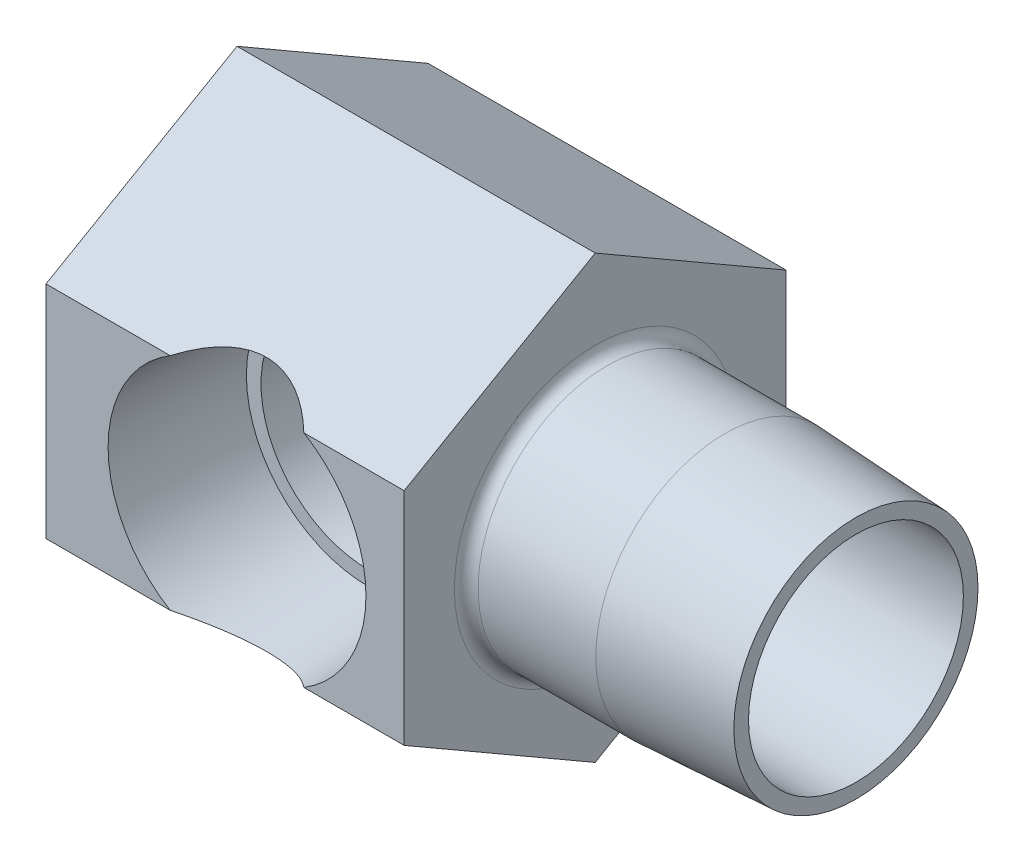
ISO-10303-21;
HEADER;
FILE_DESCRIPTION(('STEP AP214'),'2;1');
FILE_NAME('part.step','',(''),(''),'','','');
FILE_SCHEMA(('AUTOMOTIVE_DESIGN { 1 0 10303 214 1 1 1 1 }'));
ENDSEC;
DATA;
#1=APPLICATION_CONTEXT('core data for automotive mechanical design processes');
#2=APPLICATION_PROTOCOL_DEFINITION('international standard','automotive_design',2000,#1);
#3=PRODUCT_CONTEXT('',#1,'mechanical');
#4=PRODUCT('Part','Part','',(#3));
#5=PRODUCT_RELATED_PRODUCT_CATEGORY('part','',(#4));
#6=PRODUCT_DEFINITION_FORMATION('','',#4);
#7=PRODUCT_DEFINITION_CONTEXT('part definition',#1,'design');
#8=PRODUCT_DEFINITION('design','',#6,#7);
#9=PRODUCT_DEFINITION_SHAPE('','',#8);
#10=(LENGTH_UNIT() NAMED_UNIT(*) SI_UNIT(.MILLI.,.METRE.));
#11=(NAMED_UNIT(*) PLANE_ANGLE_UNIT() SI_UNIT($,.RADIAN.));
#12=(NAMED_UNIT(*) SI_UNIT($,.STERADIAN.) SOLID_ANGLE_UNIT());
#13=UNCERTAINTY_MEASURE_WITH_UNIT(LENGTH_MEASURE(1.E-05),#10,'distance_accuracy_value','');
#14=(GEOMETRIC_REPRESENTATION_CONTEXT(3) GLOBAL_UNCERTAINTY_ASSIGNED_CONTEXT((#13)) GLOBAL_UNIT_ASSIGNED_CONTEXT((#10,
#11,#12)) REPRESENTATION_CONTEXT('',''));
#15=CARTESIAN_POINT('',(0.,0.,0.));
#16=DIRECTION('',(0.,0.,1.));
#17=DIRECTION('',(1.,0.,0.));
#18=AXIS2_PLACEMENT_3D('',#15,#16,#17);
#19=CARTESIAN_POINT('',(8.72389569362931,0.,0.));
#20=DIRECTION('',(-1.,0.,0.));
#21=DIRECTION('',(0.,-1.,0.));
#22=AXIS2_PLACEMENT_3D('',#19,#20,#21);
#23=PLANE('',#22);
#24=CARTESIAN_POINT('',(8.72389569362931,0.,0.));
#25=DIRECTION('',(-1.,0.,0.));
#26=DIRECTION('',(0.,-1.,0.));
#27=AXIS2_PLACEMENT_3D('',#24,#25,#26);
#28=CIRCLE('',#27,7.1437499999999);
#29=CARTESIAN_POINT('',(8.72389569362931,-7.1437499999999,0.));
#30=VERTEX_POINT('',#29);
#31=EDGE_CURVE('E153',#30,#30,#28,.F.);
#32=ORIENTED_EDGE('',*,*,#31,.F.);
#33=EDGE_LOOP('',(#32));
#34=FACE_BOUND('',#33,.T.);
#35=CARTESIAN_POINT('',(8.72389569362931,0.,0.));
#36=DIRECTION('',(1.,0.,0.));
#37=DIRECTION('',(0.,0.,-1.));
#38=AXIS2_PLACEMENT_3D('',#35,#36,#37);
#39=CIRCLE('',#38,8.1153);
#40=CARTESIAN_POINT('',(8.72389569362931,0.,-8.1153));
#41=VERTEX_POINT('',#40);
#42=EDGE_CURVE('E154',#41,#41,#39,.T.);
#43=ORIENTED_EDGE('',*,*,#42,.T.);
#44=EDGE_LOOP('',(#43));
#45=FACE_BOUND('',#44,.T.);
#46=ADVANCED_FACE('F14',(#34,#45),#23,.F.);
#47=CARTESIAN_POINT('',(-8.61160430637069,14.6646968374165,0.));
#48=DIRECTION('',(0.,-0.866025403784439,-0.5));
#49=DIRECTION('',(0.,0.5,-0.866025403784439));
#50=AXIS2_PLACEMENT_3D('',#47,#48,#49);
#51=PLANE('',#50);
#52=CARTESIAN_POINT('',(-19.7241043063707,-0.84553451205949,26.86450873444));
#53=DIRECTION('',(0.,-0.866025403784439,-0.5));
#54=DIRECTION('',(0.,-0.5,0.866025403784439));
#55=AXIS2_PLACEMENT_3D('',#52,#53,#54);
#56=ELLIPSE('',#55,18.6296608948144,9.27637524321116);
#57=CARTESIAN_POINT('',(-15.282885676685,7.33234841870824,12.7));
#58=VERTEX_POINT('',#57);
#59=CARTESIAN_POINT('',(-24.1653229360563,7.33234841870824,12.7));
#60=VERTEX_POINT('',#59);
#61=EDGE_CURVE('E208',#58,#60,#56,.F.);
#62=ORIENTED_EDGE('',*,*,#61,.F.);
#63=DIRECTION('',(-1.,0.,0.));
#64=VECTOR('',#63,1.);
#65=CARTESIAN_POINT('',(-8.61160430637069,7.33234841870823,12.7));
#66=LINE('',#65,#64);
#67=CARTESIAN_POINT('',(-8.61160430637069,7.33234841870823,12.7));
#68=VERTEX_POINT('',#67);
#69=EDGE_CURVE('E178',#68,#58,#66,.T.);
#70=ORIENTED_EDGE('',*,*,#69,.F.);
#71=DIRECTION('',(0.,-0.5,0.866025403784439));
#72=VECTOR('',#71,1.);
#73=CARTESIAN_POINT('',(-8.61160430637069,14.6646968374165,0.));
#74=LINE('',#73,#72);
#75=CARTESIAN_POINT('',(-8.61160430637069,14.6646968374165,0.));
#76=VERTEX_POINT('',#75);
#77=EDGE_CURVE('E198',#76,#68,#74,.T.);
#78=ORIENTED_EDGE('',*,*,#77,.F.);
#79=DIRECTION('',(-1.,0.,0.));
#80=VECTOR('',#79,1.);
#81=CARTESIAN_POINT('',(-8.61160430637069,14.6646968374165,0.));
#82=LINE('',#81,#80);
#83=CARTESIAN_POINT('',(-32.4241043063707,14.6646968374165,0.));
#84=VERTEX_POINT('',#83);
#85=EDGE_CURVE('E175',#76,#84,#82,.T.);
#86=ORIENTED_EDGE('',*,*,#85,.T.);
#87=DIRECTION('',(0.,-0.5,0.866025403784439));
#88=VECTOR('',#87,1.);
#89=CARTESIAN_POINT('',(-32.4241043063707,14.6646968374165,0.));
#90=LINE('',#89,#88);
#91=CARTESIAN_POINT('',(-32.4241043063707,7.33234841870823,12.7));
#92=VERTEX_POINT('',#91);
#93=EDGE_CURVE('E215',#84,#92,#90,.T.);
#94=ORIENTED_EDGE('',*,*,#93,.T.);
#95=EDGE_CURVE('E181',#60,#92,#66,.T.);
#96=ORIENTED_EDGE('',*,*,#95,.F.);
#97=EDGE_LOOP('',(#62,#70,#78,#86,#94,#96));
#98=FACE_BOUND('',#97,.T.);
#99=ADVANCED_FACE('F241',(#98),#51,.F.);
#100=CARTESIAN_POINT('',(-8.61160430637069,7.33234841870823,12.7));
#101=DIRECTION('',(0.,0.,-1.));
#102=DIRECTION('',(-1.,0.,0.));
#103=AXIS2_PLACEMENT_3D('',#100,#101,#102);
#104=PLANE('',#103);
#105=CARTESIAN_POINT('',(-19.7241043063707,0.,12.7));
#106=DIRECTION('',(0.,0.,-1.));
#107=DIRECTION('',(-1.,0.,0.));
#108=AXIS2_PLACEMENT_3D('',#105,#106,#107);
#109=CIRCLE('',#108,8.5725);
#110=CARTESIAN_POINT('',(-15.2828856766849,-7.33234841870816,12.7));
#111=VERTEX_POINT('',#110);
#112=EDGE_CURVE('E225',#58,#111,#109,.T.);
#113=ORIENTED_EDGE('',*,*,#112,.T.);
#114=DIRECTION('',(-1.,0.,0.));
#115=VECTOR('',#114,1.);
#116=CARTESIAN_POINT('',(-8.61160430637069,-7.33234841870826,12.7));
#117=LINE('',#116,#115);
#118=CARTESIAN_POINT('',(-8.61160430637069,-7.33234841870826,12.7));
#119=VERTEX_POINT('',#118);
#120=EDGE_CURVE('E182',#119,#111,#117,.T.);
#121=ORIENTED_EDGE('',*,*,#120,.F.);
#122=DIRECTION('',(0.,-1.,0.));
#123=VECTOR('',#122,1.);
#124=CARTESIAN_POINT('',(-8.61160430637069,7.33234841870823,12.7));
#125=LINE('',#124,#123);
#126=EDGE_CURVE('E196',#68,#119,#125,.T.);
#127=ORIENTED_EDGE('',*,*,#126,.F.);
#128=ORIENTED_EDGE('',*,*,#69,.T.);
#129=EDGE_LOOP('',(#113,#121,#127,#128));
#130=FACE_BOUND('',#129,.T.);
#131=ADVANCED_FACE('F247',(#130),#104,.F.);
#132=CARTESIAN_POINT('',(-24.1653229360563,-7.33234841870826,12.7));
#133=VERTEX_POINT('',#132);
#134=EDGE_CURVE('E37',#133,#60,#109,.T.);
#135=ORIENTED_EDGE('',*,*,#134,.T.);
#136=ORIENTED_EDGE('',*,*,#95,.T.);
#137=DIRECTION('',(0.,-1.,0.));
#138=VECTOR('',#137,1.);
#139=CARTESIAN_POINT('',(-32.4241043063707,7.33234841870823,12.7));
#140=LINE('',#139,#138);
#141=CARTESIAN_POINT('',(-32.4241043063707,-7.33234841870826,12.7));
#142=VERTEX_POINT('',#141);
#143=EDGE_CURVE('E211',#92,#142,#140,.T.);
#144=ORIENTED_EDGE('',*,*,#143,.T.);
#145=EDGE_CURVE('E185',#133,#142,#117,.T.);
#146=ORIENTED_EDGE('',*,*,#145,.F.);
#147=EDGE_LOOP('',(#135,#136,#144,#146));
#148=FACE_BOUND('',#147,.T.);
#149=ADVANCED_FACE('F254',(#148),#104,.F.);
#150=CARTESIAN_POINT('',(-8.61160430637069,-7.33234841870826,12.7));
#151=DIRECTION('',(0.,0.86602540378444,-0.5));
#152=DIRECTION('',(0.,0.5,0.86602540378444));
#153=AXIS2_PLACEMENT_3D('',#150,#151,#152);
#154=PLANE('',#153);
#155=CARTESIAN_POINT('',(-19.7241043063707,0.845534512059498,26.8645087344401));
#156=DIRECTION('',(0.,0.86602540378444,-0.5));
#157=DIRECTION('',(0.,0.5,0.86602540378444));
#158=AXIS2_PLACEMENT_3D('',#155,#156,#157);
#159=ELLIPSE('',#158,18.6296608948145,9.27637524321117);
#160=EDGE_CURVE('E9',#133,#111,#159,.F.);
#161=ORIENTED_EDGE('',*,*,#160,.F.);
#162=ORIENTED_EDGE('',*,*,#145,.T.);
#163=DIRECTION('',(0.,-0.5,-0.86602540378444));
#164=VECTOR('',#163,1.);
#165=CARTESIAN_POINT('',(-32.4241043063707,-7.33234841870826,12.7));
#166=LINE('',#165,#164);
#167=CARTESIAN_POINT('',(-32.4241043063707,-14.6646968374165,0.));
#168=VERTEX_POINT('',#167);
#169=EDGE_CURVE('E194',#142,#168,#166,.T.);
#170=ORIENTED_EDGE('',*,*,#169,.T.);
#171=DIRECTION('',(-1.,0.,0.));
#172=VECTOR('',#171,1.);
#173=CARTESIAN_POINT('',(-8.61160430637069,-14.6646968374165,0.));
#174=LINE('',#173,#172);
#175=CARTESIAN_POINT('',(-8.61160430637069,-14.6646968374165,0.));
#176=VERTEX_POINT('',#175);
#177=EDGE_CURVE('E186',#176,#168,#174,.T.);
#178=ORIENTED_EDGE('',*,*,#177,.F.);
#179=DIRECTION('',(0.,-0.5,-0.86602540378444));
#180=VECTOR('',#179,1.);
#181=CARTESIAN_POINT('',(-8.61160430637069,-7.33234841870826,12.7));
#182=LINE('',#181,#180);
#183=EDGE_CURVE('E189',#119,#176,#182,.T.);
#184=ORIENTED_EDGE('',*,*,#183,.F.);
#185=ORIENTED_EDGE('',*,*,#120,.T.);
#186=EDGE_LOOP('',(#161,#162,#170,#178,#184,#185));
#187=FACE_BOUND('',#186,.T.);
#188=ADVANCED_FACE('F270',(#187),#154,.F.);
#189=CARTESIAN_POINT('',(-8.61160430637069,-14.6646968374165,0.));
#190=DIRECTION('',(0.,0.866025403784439,0.5));
#191=DIRECTION('',(0.,-0.5,0.866025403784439));
#192=AXIS2_PLACEMENT_3D('',#189,#190,#191);
#193=PLANE('',#192);
#194=DIRECTION('',(0.,0.5,-0.866025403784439));
#195=VECTOR('',#194,1.);
#196=CARTESIAN_POINT('',(-32.4241043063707,-14.6646968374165,0.));
#197=LINE('',#196,#195);
#198=CARTESIAN_POINT('',(-32.4241043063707,-7.33234841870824,-12.7));
#199=VERTEX_POINT('',#198);
#200=EDGE_CURVE('E203',#168,#199,#197,.T.);
#201=ORIENTED_EDGE('',*,*,#200,.T.);
#202=DIRECTION('',(-1.,0.,0.));
#203=VECTOR('',#202,1.);
#204=CARTESIAN_POINT('',(-8.61160430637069,-7.33234841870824,-12.7));
#205=LINE('',#204,#203);
#206=CARTESIAN_POINT('',(-8.61160430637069,-7.33234841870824,-12.7));
#207=VERTEX_POINT('',#206);
#208=EDGE_CURVE('E169',#207,#199,#205,.T.);
#209=ORIENTED_EDGE('',*,*,#208,.F.);
#210=DIRECTION('',(0.,0.5,-0.866025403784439));
#211=VECTOR('',#210,1.);
#212=CARTESIAN_POINT('',(-8.61160430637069,-14.6646968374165,0.));
#213=LINE('',#212,#211);
#214=EDGE_CURVE('E190',#176,#207,#213,.T.);
#215=ORIENTED_EDGE('',*,*,#214,.F.);
#216=ORIENTED_EDGE('',*,*,#177,.T.);
#217=EDGE_LOOP('',(#201,#209,#215,#216));
#218=FACE_BOUND('',#217,.T.);
#219=ADVANCED_FACE('F267',(#218),#193,.F.);
#220=CARTESIAN_POINT('',(-8.61160430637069,-7.33234841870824,-12.7));
#221=DIRECTION('',(0.,0.,1.));
#222=DIRECTION('',(0.,-1.,0.));
#223=AXIS2_PLACEMENT_3D('',#220,#221,#222);
#224=PLANE('',#223);
#225=DIRECTION('',(0.,1.,0.));
#226=VECTOR('',#225,1.);
#227=CARTESIAN_POINT('',(-32.4241043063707,-7.33234841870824,-12.7));
#228=LINE('',#227,#226);
#229=CARTESIAN_POINT('',(-32.4241043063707,7.33234841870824,-12.7));
#230=VERTEX_POINT('',#229);
#231=EDGE_CURVE('E207',#199,#230,#228,.T.);
#232=ORIENTED_EDGE('',*,*,#231,.T.);
#233=DIRECTION('',(-1.,0.,0.));
#234=VECTOR('',#233,1.);
#235=CARTESIAN_POINT('',(-8.61160430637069,7.33234841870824,-12.7));
#236=LINE('',#235,#234);
#237=CARTESIAN_POINT('',(-8.61160430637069,7.33234841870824,-12.7));
#238=VERTEX_POINT('',#237);
#239=EDGE_CURVE('E172',#238,#230,#236,.T.);
#240=ORIENTED_EDGE('',*,*,#239,.F.);
#241=DIRECTION('',(0.,1.,0.));
#242=VECTOR('',#241,1.);
#243=CARTESIAN_POINT('',(-8.61160430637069,-7.33234841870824,-12.7));
#244=LINE('',#243,#242);
#245=EDGE_CURVE('E193',#207,#238,#244,.T.);
#246=ORIENTED_EDGE('',*,*,#245,.F.);
#247=ORIENTED_EDGE('',*,*,#208,.T.);
#248=EDGE_LOOP('',(#232,#240,#246,#247));
#249=FACE_BOUND('',#248,.T.);
#250=ADVANCED_FACE('F264',(#249),#224,.F.);
#251=CARTESIAN_POINT('',(-8.61160430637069,7.33234841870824,-12.7));
#252=DIRECTION('',(0.,-0.866025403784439,0.5));
#253=DIRECTION('',(0.,-0.5,-0.866025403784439));
#254=AXIS2_PLACEMENT_3D('',#251,#252,#253);
#255=PLANE('',#254);
#256=DIRECTION('',(0.,0.5,0.866025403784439));
#257=VECTOR('',#256,1.);
#258=CARTESIAN_POINT('',(-32.4241043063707,7.33234841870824,-12.7));
#259=LINE('',#258,#257);
#260=EDGE_CURVE('E219',#230,#84,#259,.T.);
#261=ORIENTED_EDGE('',*,*,#260,.T.);
#262=ORIENTED_EDGE('',*,*,#85,.F.);
#263=DIRECTION('',(0.,0.5,0.866025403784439));
#264=VECTOR('',#263,1.);
#265=CARTESIAN_POINT('',(-8.61160430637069,7.33234841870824,-12.7));
#266=LINE('',#265,#264);
#267=EDGE_CURVE('E200',#238,#76,#266,.T.);
#268=ORIENTED_EDGE('',*,*,#267,.F.);
#269=ORIENTED_EDGE('',*,*,#239,.T.);
#270=EDGE_LOOP('',(#261,#262,#268,#269));
#271=FACE_BOUND('',#270,.T.);
#272=ADVANCED_FACE('F260',(#271),#255,.F.);
#273=CARTESIAN_POINT('',(-8.61160430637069,-21.9970452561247,12.7));
#274=DIRECTION('',(-1.,0.,0.));
#275=DIRECTION('',(0.,-1.,0.));
#276=AXIS2_PLACEMENT_3D('',#273,#274,#275);
#277=PLANE('',#276);
#278=CARTESIAN_POINT('',(-8.61160430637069,0.,0.));
#279=DIRECTION('',(-1.,0.,0.));
#280=DIRECTION('',(0.,-1.,0.));
#281=AXIS2_PLACEMENT_3D('',#278,#279,#280);
#282=CIRCLE('',#281,9.3599);
#283=CARTESIAN_POINT('',(-8.61160430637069,-9.35989999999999,0.));
#284=VERTEX_POINT('',#283);
#285=EDGE_CURVE('E166',#284,#284,#282,.T.);
#286=ORIENTED_EDGE('',*,*,#285,.T.);
#287=EDGE_LOOP('',(#286));
#288=FACE_BOUND('',#287,.T.);
#289=ORIENTED_EDGE('',*,*,#214,.T.);
#290=ORIENTED_EDGE('',*,*,#245,.T.);
#291=ORIENTED_EDGE('',*,*,#267,.T.);
#292=ORIENTED_EDGE('',*,*,#77,.T.);
#293=ORIENTED_EDGE('',*,*,#126,.T.);
#294=ORIENTED_EDGE('',*,*,#183,.T.);
#295=EDGE_LOOP('',(#289,#290,#291,#292,#293,#294));
#296=FACE_BOUND('',#295,.T.);
#297=ADVANCED_FACE('F263',(#288,#296),#277,.F.);
#298=CARTESIAN_POINT('',(-32.4241043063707,-21.9970452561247,12.7));
#299=DIRECTION('',(-1.,0.,0.));
#300=DIRECTION('',(0.,-1.,0.));
#301=AXIS2_PLACEMENT_3D('',#298,#299,#300);
#302=PLANE('',#301);
#303=ORIENTED_EDGE('',*,*,#200,.F.);
#304=ORIENTED_EDGE('',*,*,#169,.F.);
#305=ORIENTED_EDGE('',*,*,#143,.F.);
#306=ORIENTED_EDGE('',*,*,#93,.F.);
#307=ORIENTED_EDGE('',*,*,#260,.F.);
#308=ORIENTED_EDGE('',*,*,#231,.F.);
#309=EDGE_LOOP('',(#303,#304,#305,#306,#307,#308));
#310=FACE_BOUND('',#309,.T.);
#311=ADVANCED_FACE('F283',(#310),#302,.T.);
#312=CARTESIAN_POINT('',(31.0758956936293,0.,0.));
#313=DIRECTION('',(-1.,0.,0.));
#314=DIRECTION('',(0.,-1.,0.));
#315=AXIS2_PLACEMENT_3D('',#312,#313,#314);
#316=CYLINDRICAL_SURFACE('',#315,8.5725);
#317=CARTESIAN_POINT('',(0.,0.,0.));
#318=DIRECTION('',(-1.,0.,0.));
#319=DIRECTION('',(0.,0.,1.));
#320=AXIS2_PLACEMENT_3D('',#317,#318,#319);
#321=CIRCLE('',#320,8.5725);
#322=CARTESIAN_POINT('',(0.,0.,8.5725));
#323=VERTEX_POINT('',#322);
#324=EDGE_CURVE('E17',#323,#323,#321,.F.);
#325=ORIENTED_EDGE('',*,*,#324,.F.);
#326=EDGE_LOOP('',(#325));
#327=FACE_BOUND('',#326,.T.);
#328=CARTESIAN_POINT('',(-7.82420430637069,0.,0.));
#329=DIRECTION('',(-1.,0.,0.));
#330=DIRECTION('',(0.,-1.,0.));
#331=AXIS2_PLACEMENT_3D('',#328,#329,#330);
#332=CIRCLE('',#331,8.5725);
#333=CARTESIAN_POINT('',(-7.82420430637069,-8.57249999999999,0.));
#334=VERTEX_POINT('',#333);
#335=EDGE_CURVE('E22',#334,#334,#332,.F.);
#336=ORIENTED_EDGE('',*,*,#335,.T.);
#337=EDGE_LOOP('',(#336));
#338=FACE_BOUND('',#337,.T.);
#339=ADVANCED_FACE('F308',(#327,#338),#316,.T.);
#340=CARTESIAN_POINT('',(-7.82420430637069,0.,0.));
#341=DIRECTION('',(-1.,0.,0.));
#342=DIRECTION('',(0.,-1.,0.));
#343=AXIS2_PLACEMENT_3D('',#340,#341,#342);
#344=TOROIDAL_SURFACE('',#343,9.3599,0.7874);
#345=ORIENTED_EDGE('',*,*,#335,.F.);
#346=EDGE_LOOP('',(#345));
#347=FACE_BOUND('',#346,.T.);
#348=ORIENTED_EDGE('',*,*,#285,.F.);
#349=EDGE_LOOP('',(#348));
#350=FACE_BOUND('',#349,.T.);
#351=ADVANCED_FACE('F300',(#347,#350),#344,.F.);
#352=CARTESIAN_POINT('',(-19.7241043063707,0.,12.7));
#353=DIRECTION('',(0.,0.,1.));
#354=DIRECTION('',(1.,0.,0.));
#355=AXIS2_PLACEMENT_3D('',#352,#353,#354);
#356=CONICAL_SURFACE('',#355,8.5725,0.0523598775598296);
#357=CARTESIAN_POINT('',(-14.2003255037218,-5.94425228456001,3.9622));
#358=CARTESIAN_POINT('',(-14.1324866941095,-5.88732299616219,4.0476009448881));
#359=CARTESIAN_POINT('',(-14.0648247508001,-5.82850059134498,4.13186763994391));
#360=CARTESIAN_POINT('',(-13.9301074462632,-5.70702027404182,4.29810357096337));
#361=CARTESIAN_POINT('',(-13.8630521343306,-5.64436205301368,4.38007262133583));
#362=CARTESIAN_POINT('',(-13.6629969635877,-5.45038497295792,4.62270587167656));
#363=CARTESIAN_POINT('',(-13.5313078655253,-5.31322998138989,4.77984608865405));
#364=CARTESIAN_POINT('',(-13.2722462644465,-5.0216447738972,5.08539714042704));
#365=CARTESIAN_POINT('',(-13.1449307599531,-4.8670541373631,5.23370383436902));
#366=CARTESIAN_POINT('',(-12.8983290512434,-4.5416930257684,5.51841842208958));
#367=CARTESIAN_POINT('',(-12.7790372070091,-4.37093412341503,5.65483469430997));
#368=CARTESIAN_POINT('',(-12.4945597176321,-3.92497659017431,5.97796938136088));
#369=CARTESIAN_POINT('',(-12.3355454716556,-3.63961711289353,6.15656187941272));
#370=CARTESIAN_POINT('',(-12.1209776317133,-3.18637161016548,6.39604116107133));
#371=CARTESIAN_POINT('',(-12.053530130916,-3.03133869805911,6.47104185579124));
#372=CARTESIAN_POINT('',(-11.9275565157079,-2.71316594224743,6.61075170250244));
#373=CARTESIAN_POINT('',(-11.8690289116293,-2.55002745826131,6.67546257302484));
#374=CARTESIAN_POINT('',(-11.7702637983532,-2.24208944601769,6.78444097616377));
#375=CARTESIAN_POINT('',(-11.7285978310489,-2.09831594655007,6.83032177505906));
#376=CARTESIAN_POINT('',(-11.6531438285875,-1.80624508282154,6.91329708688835));
#377=CARTESIAN_POINT('',(-11.6193543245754,-1.65794856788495,6.95039323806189));
#378=CARTESIAN_POINT('',(-11.5602295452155,-1.35762804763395,7.0152415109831));
#379=CARTESIAN_POINT('',(-11.5348960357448,-1.20560327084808,7.04299168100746));
#380=CARTESIAN_POINT('',(-11.4931698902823,-0.898862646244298,7.08867062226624));
#381=CARTESIAN_POINT('',(-11.4767773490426,-0.744146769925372,7.10659928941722));
#382=CARTESIAN_POINT('',(-11.4532269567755,-0.43270553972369,7.13234993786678));
#383=CARTESIAN_POINT('',(-11.4460967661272,-0.275975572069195,7.14014164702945));
#384=CARTESIAN_POINT('',(-11.4413099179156,0.0378027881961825,7.14537304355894));
#385=CARTESIAN_POINT('',(-11.443653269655,0.1948511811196,7.14281272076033));
#386=CARTESIAN_POINT('',(-11.4577644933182,0.508011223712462,7.12738842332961));
#387=CARTESIAN_POINT('',(-11.4695323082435,0.664122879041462,7.11452451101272));
#388=CARTESIAN_POINT('',(-11.5022497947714,0.974205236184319,7.07873224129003));
#389=CARTESIAN_POINT('',(-11.5231993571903,1.12817596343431,7.05580400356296));
#390=CARTESIAN_POINT('',(-11.5726364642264,1.42545941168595,7.00163744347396));
#391=CARTESIAN_POINT('',(-11.6007067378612,1.56892578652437,6.97085873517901));
#392=CARTESIAN_POINT('',(-11.664316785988,1.8521546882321,6.90101441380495));
#393=CARTESIAN_POINT('',(-11.6998593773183,1.99191579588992,6.86194567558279));
#394=CARTESIAN_POINT('',(-11.8168977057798,2.40450989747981,6.73307738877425));
#395=CARTESIAN_POINT('',(-11.9088446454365,2.67089071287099,6.63157144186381));
#396=CARTESIAN_POINT('',(-12.0832976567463,3.10208873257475,6.43796899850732));
#397=CARTESIAN_POINT('',(-12.1597823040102,3.27264094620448,6.35283630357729));
#398=CARTESIAN_POINT('',(-12.3220620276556,3.60309741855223,6.17141529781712));
#399=CARTESIAN_POINT('',(-12.4078603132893,3.76299797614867,6.07512314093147));
#400=CARTESIAN_POINT('',(-12.6775398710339,4.22699236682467,5.7708514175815));
#401=CARTESIAN_POINT('',(-12.8733755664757,4.51459085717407,5.54784008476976));
#402=CARTESIAN_POINT('',(-13.1675709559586,4.89305951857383,5.20716223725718));
#403=CARTESIAN_POINT('',(-13.2577257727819,5.00247887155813,5.10207030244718));
#404=CARTESIAN_POINT('',(-13.4410889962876,5.21324568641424,4.88650457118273));
#405=CARTESIAN_POINT('',(-13.5342974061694,5.31459313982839,4.77603076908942));
#406=CARTESIAN_POINT('',(-13.7222110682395,5.50848003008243,4.55101294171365));
#407=CARTESIAN_POINT('',(-13.8168981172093,5.60108407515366,4.43650906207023));
#408=CARTESIAN_POINT('',(-14.0077134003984,5.77848578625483,4.20282228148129));
#409=CARTESIAN_POINT('',(-14.1038412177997,5.86328566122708,4.08364071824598));
#410=CARTESIAN_POINT('',(-14.2003255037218,5.94425228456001,3.9622));
#411=B_SPLINE_CURVE_WITH_KNOTS('',3,(#357,#358,#359,#360,#361,#362,#363,#364,#365,#366,#367,
#368,#369,#370,#371,#372,#373,#374,#375,#376,#377,#378,#379,#380,#381,#382,#383,#384,#385,#386,
#387,#388,#389,#390,#391,#392,#393,#394,#395,#396,#397,#398,#399,#400,#401,#402,#403,#404,#405,
#406,#407,#408,#409,#410),.UNSPECIFIED.,.F.,.F.,(4,2,2,2,2,2,2,2,2,2,2,2,2,2,2,2,2,2,2,2,2,2,2,
2,2,2,4),(0.,0.369050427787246,0.738130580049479,1.47737063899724,2.22407355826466,
2.97024599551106,4.0822255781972,4.63656388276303,5.19080950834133,5.66002823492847,
6.12915938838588,6.59838844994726,7.0676224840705,7.53825460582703,8.00888718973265,
8.47951692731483,8.95014106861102,9.3978219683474,9.8456719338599,10.7406458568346,
11.3560801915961,11.9717272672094,13.2057730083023,13.7350494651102,14.2643264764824,
14.7893227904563,15.3141700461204),.UNSPECIFIED.);
#412=CARTESIAN_POINT('',(-14.2001666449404,-5.94411896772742,3.9624));
#413=VERTEX_POINT('',#412);
#414=CARTESIAN_POINT('',(-14.2001666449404,5.94411896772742,3.9624));
#415=VERTEX_POINT('',#414);
#416=EDGE_CURVE('E129',#413,#415,#411,.T.);
#417=ORIENTED_EDGE('',*,*,#416,.F.);
#418=CARTESIAN_POINT('',(-19.7241043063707,0.,3.9624));
#419=DIRECTION('',(0.,0.,-1.));
#420=DIRECTION('',(-1.,0.,0.));
#421=AXIS2_PLACEMENT_3D('',#418,#419,#420);
#422=CIRCLE('',#421,8.1145817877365);
#423=EDGE_CURVE('E227',#413,#415,#422,.T.);
#424=ORIENTED_EDGE('',*,*,#423,.T.);
#425=EDGE_LOOP('',(#417,#424));
#426=FACE_BOUND('',#425,.T.);
#427=ORIENTED_EDGE('',*,*,#61,.T.);
#428=ORIENTED_EDGE('',*,*,#134,.F.);
#429=ORIENTED_EDGE('',*,*,#160,.T.);
#430=ORIENTED_EDGE('',*,*,#112,.F.);
#431=EDGE_LOOP('',(#427,#428,#429,#430));
#432=FACE_BOUND('',#431,.T.);
#433=ADVANCED_FACE('F137',(#426,#432),#356,.F.);
#434=CARTESIAN_POINT('',(-11.6095225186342,0.,3.9624));
#435=DIRECTION('',(0.,0.,1.));
#436=DIRECTION('',(1.,0.,0.));
#437=AXIS2_PLACEMENT_3D('',#434,#435,#436);
#438=PLANE('',#437);
#439=DIRECTION('',(1.,0.,0.));
#440=VECTOR('',#439,1.);
#441=CARTESIAN_POINT('',(34.2434165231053,-5.94411896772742,3.9624));
#442=LINE('',#441,#440);
#443=CARTESIAN_POINT('',(-15.7617043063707,-5.9441189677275,3.9624));
#444=VERTEX_POINT('',#443);
#445=EDGE_CURVE('E124',#444,#413,#442,.T.);
#446=ORIENTED_EDGE('',*,*,#445,.F.);
#447=CARTESIAN_POINT('',(-19.7241043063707,0.,3.9624));
#448=DIRECTION('',(0.,0.,-1.));
#449=DIRECTION('',(-1.,0.,0.));
#450=AXIS2_PLACEMENT_3D('',#447,#448,#449);
#451=CIRCLE('',#450,7.14375);
#452=CARTESIAN_POINT('',(-15.7617043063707,5.9441189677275,3.9624));
#453=VERTEX_POINT('',#452);
#454=EDGE_CURVE('E120',#444,#453,#451,.T.);
#455=ORIENTED_EDGE('',*,*,#454,.T.);
#456=DIRECTION('',(1.,0.,0.));
#457=VECTOR('',#456,1.);
#458=CARTESIAN_POINT('',(34.2434165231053,5.94411896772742,3.9624));
#459=LINE('',#458,#457);
#460=EDGE_CURVE('E121',#415,#453,#459,.F.);
#461=ORIENTED_EDGE('',*,*,#460,.F.);
#462=ORIENTED_EDGE('',*,*,#423,.F.);
#463=EDGE_LOOP('',(#446,#455,#461,#462));
#464=FACE_BOUND('',#463,.T.);
#465=ADVANCED_FACE('F239',(#464),#438,.T.);
#466=CARTESIAN_POINT('',(-19.7241043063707,0.,21.895573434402));
#467=DIRECTION('',(0.,0.,-1.));
#468=DIRECTION('',(-1.,0.,0.));
#469=AXIS2_PLACEMENT_3D('',#466,#467,#468);
#470=CYLINDRICAL_SURFACE('',#469,7.14375);
#471=CARTESIAN_POINT('',(-19.7241043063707,0.,0.));
#472=DIRECTION('',(0.707106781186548,0.,-0.707106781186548));
#473=DIRECTION('',(-0.707106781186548,0.,-0.707106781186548));
#474=AXIS2_PLACEMENT_3D('',#471,#472,#473);
#475=ELLIPSE('',#474,10.1027881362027,7.14375);
#476=CARTESIAN_POINT('',(-19.7241043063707,7.14375,0.));
#477=VERTEX_POINT('',#476);
#478=EDGE_CURVE('E122',#453,#477,#475,.F.);
#479=ORIENTED_EDGE('',*,*,#478,.F.);
#480=ORIENTED_EDGE('',*,*,#454,.F.);
#481=CARTESIAN_POINT('',(-19.7241043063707,-7.14375,0.));
#482=VERTEX_POINT('',#481);
#483=EDGE_CURVE('E109',#482,#444,#475,.F.);
#484=ORIENTED_EDGE('',*,*,#483,.F.);
#485=CARTESIAN_POINT('',(-19.7241043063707,0.,0.));
#486=DIRECTION('',(-0.707106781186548,0.,-0.707106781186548));
#487=DIRECTION('',(0.707106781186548,0.,-0.707106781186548));
#488=AXIS2_PLACEMENT_3D('',#485,#486,#487);
#489=ELLIPSE('',#488,10.1027881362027,7.14375);
#490=CARTESIAN_POINT('',(-14.3235502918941,-4.67623570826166,-5.4005540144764));
#491=VERTEX_POINT('',#490);
#492=EDGE_CURVE('E105',#491,#482,#489,.T.);
#493=ORIENTED_EDGE('',*,*,#492,.F.);
#494=CARTESIAN_POINT('',(-19.7241043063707,0.,-5.4005540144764));
#495=DIRECTION('',(0.,0.,-1.));
#496=DIRECTION('',(-1.,0.,0.));
#497=AXIS2_PLACEMENT_3D('',#494,#495,#496);
#498=CIRCLE('',#497,7.14375);
#499=CARTESIAN_POINT('',(-14.3235502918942,4.67623570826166,-5.4005540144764));
#500=VERTEX_POINT('',#499);
#501=EDGE_CURVE('E135',#491,#500,#498,.T.);
#502=ORIENTED_EDGE('',*,*,#501,.T.);
#503=EDGE_CURVE('E30',#477,#500,#489,.T.);
#504=ORIENTED_EDGE('',*,*,#503,.F.);
#505=EDGE_LOOP('',(#479,#480,#484,#493,#502,#504));
#506=FACE_BOUND('',#505,.T.);
#507=ADVANCED_FACE('F118',(#506),#470,.F.);
#508=CARTESIAN_POINT('',(-19.7241043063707,0.,-5.4005540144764));
#509=DIRECTION('',(0.,0.,1.));
#510=DIRECTION('',(1.,0.,0.));
#511=AXIS2_PLACEMENT_3D('',#508,#509,#510);
#512=CONICAL_SURFACE('',#511,7.14375,1.0471975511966);
#513=CARTESIAN_POINT('',(-14.3232920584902,4.67646667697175,-5.40035401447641));
#514=CARTESIAN_POINT('',(-14.4058558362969,4.60263120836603,-5.46427833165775));
#515=CARTESIAN_POINT('',(-14.4857804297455,4.52571856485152,-5.52824444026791));
#516=CARTESIAN_POINT('',(-14.6392479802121,4.36518020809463,-5.6558771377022));
#517=CARTESIAN_POINT('',(-14.7127782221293,4.28154172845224,-5.71954290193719));
#518=CARTESIAN_POINT('',(-14.8514566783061,4.1079855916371,-5.8454252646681));
#519=CARTESIAN_POINT('',(-14.9166681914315,4.01812452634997,-5.90764943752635));
#520=CARTESIAN_POINT('',(-15.0381322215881,3.83151153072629,-6.03035165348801));
#521=CARTESIAN_POINT('',(-15.0943910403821,3.73476451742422,-6.09083090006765));
#522=CARTESIAN_POINT('',(-15.1976879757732,3.53345239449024,-6.20980651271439));
#523=CARTESIAN_POINT('',(-15.2446102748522,3.42880893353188,-6.26827132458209));
#524=CARTESIAN_POINT('',(-15.3280805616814,3.21346156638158,-6.38134917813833));
#525=CARTESIAN_POINT('',(-15.364626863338,3.10275667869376,-6.43596159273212));
#526=CARTESIAN_POINT('',(-15.4278500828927,2.87633249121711,-6.54029167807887));
#527=CARTESIAN_POINT('',(-15.4545249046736,2.76061213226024,-6.59000830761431));
#528=CARTESIAN_POINT('',(-15.4992676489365,2.52527852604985,-6.68372576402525));
#529=CARTESIAN_POINT('',(-15.5173339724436,2.40566455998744,-6.72772552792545));
#530=CARTESIAN_POINT('',(-15.5519540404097,2.11917129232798,-6.82442163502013));
#531=CARTESIAN_POINT('',(-15.5655323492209,1.95102064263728,-6.87440411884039));
#532=CARTESIAN_POINT('',(-15.5845794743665,1.61106163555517,-6.96193304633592));
#533=CARTESIAN_POINT('',(-15.5900438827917,1.43925134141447,-6.99947272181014));
#534=CARTESIAN_POINT('',(-15.596882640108,1.09272483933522,-7.06188401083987));
#535=CARTESIAN_POINT('',(-15.5982440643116,0.918001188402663,-7.08671538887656));
#536=CARTESIAN_POINT('',(-15.599619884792,0.567245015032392,-7.123376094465));
#537=CARTESIAN_POINT('',(-15.5996346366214,0.391212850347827,-7.13520885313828));
#538=CARTESIAN_POINT('',(-15.5996727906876,0.0298631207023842,-7.14608765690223));
#539=CARTESIAN_POINT('',(-15.5996965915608,-0.155475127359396,-7.14445894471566));
#540=CARTESIAN_POINT('',(-15.5995561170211,-0.52551757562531,-7.1268025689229));
#541=CARTESIAN_POINT('',(-15.5993917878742,-0.7102215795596,-7.11077079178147));
#542=CARTESIAN_POINT('',(-15.5968677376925,-1.07761401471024,-7.06442938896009));
#543=CARTESIAN_POINT('',(-15.5945103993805,-1.26030441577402,-7.03413527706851));
#544=CARTESIAN_POINT('',(-15.5838934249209,-1.62260116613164,-6.95948868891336));
#545=CARTESIAN_POINT('',(-15.5756366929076,-1.80220898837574,-6.91514313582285));
#546=CARTESIAN_POINT('',(-15.5527257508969,-2.09762253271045,-6.82995527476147));
#547=CARTESIAN_POINT('',(-15.5411192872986,-2.21474934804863,-6.79286777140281));
#548=CARTESIAN_POINT('',(-15.5113740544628,-2.44618190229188,-6.71299673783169));
#549=CARTESIAN_POINT('',(-15.493237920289,-2.56048875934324,-6.67021550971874));
#550=CARTESIAN_POINT('',(-15.4490115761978,-2.78506409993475,-6.57960415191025));
#551=CARTESIAN_POINT('',(-15.4229489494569,-2.89534512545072,-6.53179190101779));
#552=CARTESIAN_POINT('',(-15.3617784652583,-3.11130073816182,-6.43172852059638));
#553=CARTESIAN_POINT('',(-15.3266713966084,-3.21697572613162,-6.3794777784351));
#554=CARTESIAN_POINT('',(-15.2467532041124,-3.42340093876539,-6.27113700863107));
#555=CARTESIAN_POINT('',(-15.2018876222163,-3.52411947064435,-6.21502669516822));
#556=CARTESIAN_POINT('',(-15.1028343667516,-3.71931545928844,-6.10022022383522));
#557=CARTESIAN_POINT('',(-15.048645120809,-3.81379185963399,-6.04152363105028));
#558=CARTESIAN_POINT('',(-14.9316251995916,-3.99641031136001,-5.92231347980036));
#559=CARTESIAN_POINT('',(-14.8687729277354,-4.08453566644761,-5.86179568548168));
#560=CARTESIAN_POINT('',(-14.7356308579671,-4.25426378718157,-5.73980247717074));
#561=CARTESIAN_POINT('',(-14.6653398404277,-4.33586547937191,-5.67832690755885));
#562=CARTESIAN_POINT('',(-14.5490443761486,-4.46018946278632,-5.58061599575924));
#563=CARTESIAN_POINT('',(-14.5050947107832,-4.5049692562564,-5.54451467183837));
#564=CARTESIAN_POINT('',(-14.4154718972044,-4.59230195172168,-5.47239564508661));
#565=CARTESIAN_POINT('',(-14.3698072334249,-4.6348638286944,-5.43637827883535));
#566=CARTESIAN_POINT('',(-14.3232920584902,-4.67646667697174,-5.40035401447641));
#567=B_SPLINE_CURVE_WITH_KNOTS('',3,(#513,#514,#515,#516,#517,#518,#519,#520,#521,#522,#523,
#524,#525,#526,#527,#528,#529,#530,#531,#532,#533,#534,#535,#536,#537,#538,#539,#540,#541,#542,
#543,#544,#545,#546,#547,#548,#549,#550,#551,#552,#553,#554,#555,#556,#557,#558,#559,#560,#561,
#562,#563,#564,#565,#566),.UNSPECIFIED.,.F.,.F.,(4,2,2,2,2,2,2,2,2,2,2,2,2,2,2,2,2,2,2,2,2,2,2,
2,2,2,4),(0.,0.38373460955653,0.768215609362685,1.14957007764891,1.53065491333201,
1.91620690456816,2.30182151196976,2.68751795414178,3.07328600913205,3.60029069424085,
4.12758157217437,4.65653172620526,5.18534222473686,5.74081422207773,6.29644491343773,
6.8514726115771,7.40622727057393,7.77616444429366,8.14595249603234,8.51446817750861,
8.8829517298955,9.25354694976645,9.62420472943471,9.99580384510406,10.3674639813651,
10.5845818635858,10.8007392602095),.UNSPECIFIED.);
#568=EDGE_CURVE('E111',#500,#491,#567,.T.);
#569=ORIENTED_EDGE('',*,*,#568,.F.);
#570=ORIENTED_EDGE('',*,*,#501,.F.);
#571=EDGE_LOOP('',(#569,#570));
#572=FACE_BOUND('',#571,.T.);
#573=CARTESIAN_POINT('',(-19.7241043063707,0.,-9.5249999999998));
#574=VERTEX_POINT('',#573);
#575=VERTEX_LOOP('',#574);
#576=FACE_BOUND('',#575,.T.);
#577=ADVANCED_FACE('F145',(#572,#576),#512,.F.);
#578=CARTESIAN_POINT('',(34.2434165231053,0.,0.));
#579=DIRECTION('',(1.,0.,0.));
#580=DIRECTION('',(0.,0.,-1.));
#581=AXIS2_PLACEMENT_3D('',#578,#579,#580);
#582=CYLINDRICAL_SURFACE('',#581,7.1437499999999);
#583=ORIENTED_EDGE('',*,*,#416,.T.);
#584=ORIENTED_EDGE('',*,*,#460,.T.);
#585=ORIENTED_EDGE('',*,*,#478,.T.);
#586=ORIENTED_EDGE('',*,*,#503,.T.);
#587=ORIENTED_EDGE('',*,*,#568,.T.);
#588=ORIENTED_EDGE('',*,*,#492,.T.);
#589=ORIENTED_EDGE('',*,*,#483,.T.);
#590=ORIENTED_EDGE('',*,*,#445,.T.);
#591=EDGE_LOOP('',(#583,#584,#585,#586,#587,#588,#589,#590));
#592=FACE_BOUND('',#591,.T.);
#593=ORIENTED_EDGE('',*,*,#31,.T.);
#594=EDGE_LOOP('',(#593));
#595=FACE_BOUND('',#594,.T.);
#596=ADVANCED_FACE('F107',(#592,#595),#582,.F.);
#597=CARTESIAN_POINT('',(-0.013704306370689,0.,0.));
#598=DIRECTION('',(-1.,0.,0.));
#599=DIRECTION('',(0.,0.,1.));
#600=AXIS2_PLACEMENT_3D('',#597,#598,#599);
#601=CONICAL_SURFACE('',#600,8.5732182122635,0.05235987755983);
#602=ORIENTED_EDGE('',*,*,#324,.T.);
#603=EDGE_LOOP('',(#602));
#604=FACE_BOUND('',#603,.T.);
#605=ORIENTED_EDGE('',*,*,#42,.F.);
#606=EDGE_LOOP('',(#605));
#607=FACE_BOUND('',#606,.T.);
#608=ADVANCED_FACE('F144',(#604,#607),#601,.T.);
#609=CLOSED_SHELL('',(#46,#99,#131,#149,#188,#219,#250,#272,#297,#311,#339,#351,#433,#465,#507,
#577,#596,#608));
#610=MANIFOLD_SOLID_BREP('B1',#609);
#611=ADVANCED_BREP_SHAPE_REPRESENTATION('',(#18,#610),#14);
#612=SHAPE_DEFINITION_REPRESENTATION(#9,#611);
ENDSEC;
END-ISO-10303-21;
